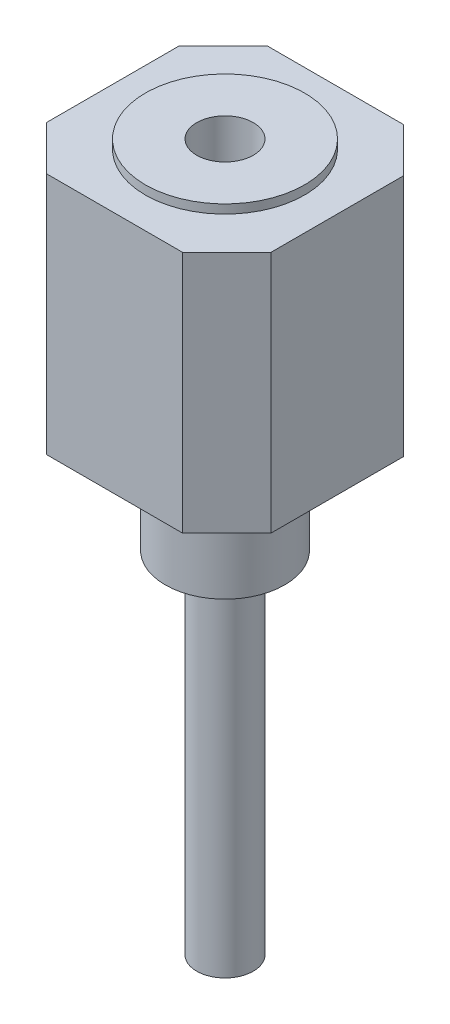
from build123d import *

# Parameters (mm, degrees)
BOSS_EXTRU_1_DEPTH      = 2.75
ESQUISSE2_R             = 0.9
BOSS_EXTRU_2_DEPTH      = 0.1
ESQUISSE3_R             = 0.675
BOSS_EXTRU_3_DEPTH      = 1.18
ESQUISSE4_R             = 0.32
BOSS_EXTRU_4_DEPTH      = 3.96
ESQUISSE5_R             = 0.32
ENL_V_MAT_EXTRU_1_DEPTH = 3.8


with BuildPart() as part:
    # Esquisse1 → Boss.-Extru.1 (new body)
    with BuildSketch(Plane(origin=(0, 0, 0), x_dir=(1, 0, 0), z_dir=(0, 1, 0))):
        Polygon((-1.27, 0.75), (-0.77, 1.25), (0.77, 1.25), (1.27, 0.75), (1.27, -0.75), (0.77, -1.25), (-0.77, -1.25), (-1.27, -0.75), align=None)
    extrude(amount=BOSS_EXTRU_1_DEPTH)

    # Esquisse2 → Boss.-Extru.2 (add)
    with BuildSketch(Plane(origin=(0, 2.75, 0), x_dir=(1, 0, 0), z_dir=(0, 1, 0))):
        with Locations(Location((0, 0, 0), (0, 0, 270))):
            Circle(ESQUISSE2_R)
    extrude(amount=BOSS_EXTRU_2_DEPTH)

    # Esquisse3 → Boss.-Extru.3 (add)
    with BuildSketch(Plane.XZ):
        with Locations(Location((0, 0, 0), (0, 0, 90))):
            Circle(ESQUISSE3_R)
    extrude(amount=BOSS_EXTRU_3_DEPTH)

    # Esquisse4 → Boss.-Extru.4 (add)
    with BuildSketch(Plane.XZ.offset(1.18)):
        with Locations(Location((0, 0, 0), (0, 0, 270))):
            Circle(ESQUISSE4_R)
    extrude(amount=BOSS_EXTRU_4_DEPTH)

    # Esquisse5 → Enl_v. mat.-Extru.1 (cut)
    with BuildSketch(Plane(origin=(0, 2.85, 0), x_dir=(1, 0, 0), z_dir=(0, 1, 0))):
        with Locations(Location((0, 0, 0), (0, 0, 90))):
            Circle(ESQUISSE5_R)
    extrude(amount=-ENL_V_MAT_EXTRU_1_DEPTH, mode=Mode.SUBTRACT)


solid = part.part
